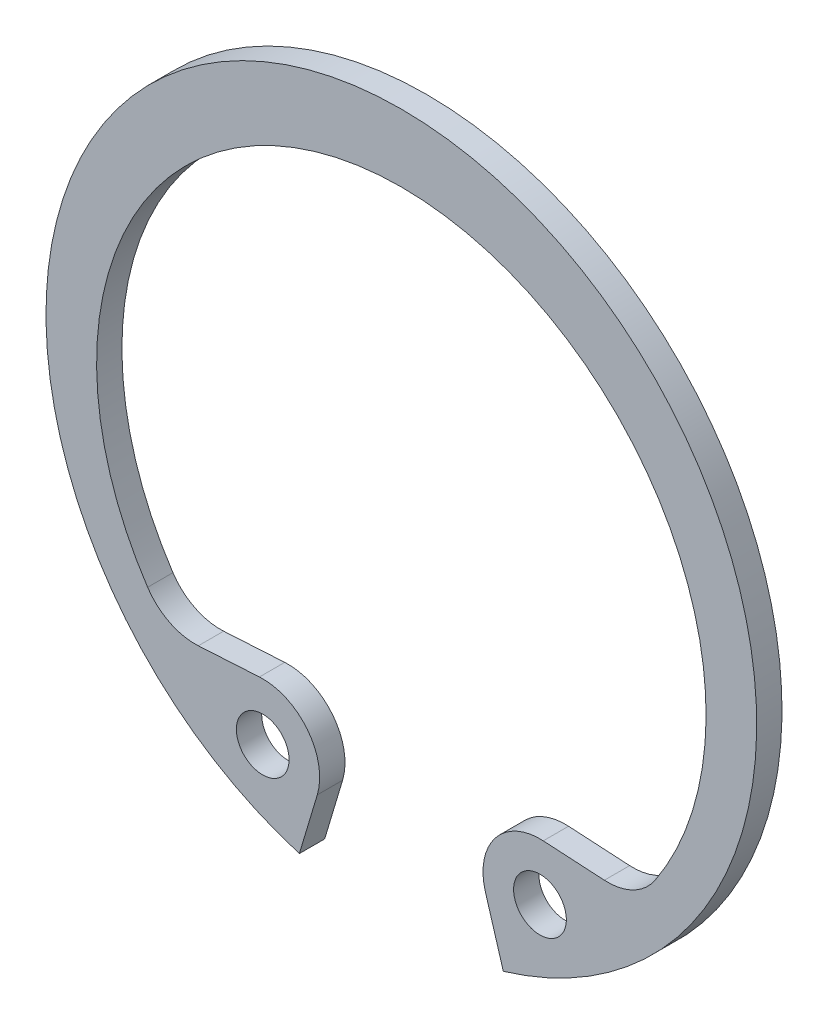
ISO-10303-21;
HEADER;
FILE_DESCRIPTION(('STEP AP214'),'2;1');
FILE_NAME('part.step','',(''),(''),'','','');
FILE_SCHEMA(('AUTOMOTIVE_DESIGN { 1 0 10303 214 1 1 1 1 }'));
ENDSEC;
DATA;
#1=APPLICATION_CONTEXT('core data for automotive mechanical design processes');
#2=APPLICATION_PROTOCOL_DEFINITION('international standard','automotive_design',2000,#1);
#3=PRODUCT_CONTEXT('',#1,'mechanical');
#4=PRODUCT('Part','Part','',(#3));
#5=PRODUCT_RELATED_PRODUCT_CATEGORY('part','',(#4));
#6=PRODUCT_DEFINITION_FORMATION('','',#4);
#7=PRODUCT_DEFINITION_CONTEXT('part definition',#1,'design');
#8=PRODUCT_DEFINITION('design','',#6,#7);
#9=PRODUCT_DEFINITION_SHAPE('','',#8);
#10=(LENGTH_UNIT() NAMED_UNIT(*) SI_UNIT(.MILLI.,.METRE.));
#11=(NAMED_UNIT(*) PLANE_ANGLE_UNIT() SI_UNIT($,.RADIAN.));
#12=(NAMED_UNIT(*) SI_UNIT($,.STERADIAN.) SOLID_ANGLE_UNIT());
#13=UNCERTAINTY_MEASURE_WITH_UNIT(LENGTH_MEASURE(1.E-05),#10,'distance_accuracy_value','');
#14=(GEOMETRIC_REPRESENTATION_CONTEXT(3) GLOBAL_UNCERTAINTY_ASSIGNED_CONTEXT((#13)) GLOBAL_UNIT_ASSIGNED_CONTEXT((#10,
#11,#12)) REPRESENTATION_CONTEXT('',''));
#15=CARTESIAN_POINT('',(0.,0.,0.));
#16=DIRECTION('',(0.,0.,1.));
#17=DIRECTION('',(1.,0.,0.));
#18=AXIS2_PLACEMENT_3D('',#15,#16,#17);
#19=CARTESIAN_POINT('',(0.,0.,0.));
#20=DIRECTION('',(0.,0.,1.));
#21=DIRECTION('',(0.999999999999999,0.,0.));
#22=AXIS2_PLACEMENT_3D('',#19,#20,#21);
#23=PLANE('',#22);
#24=CARTESIAN_POINT('',(6.57243608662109,-12.5309849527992,0.));
#25=DIRECTION('',(0.,0.,1.));
#26=DIRECTION('',(0.999999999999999,0.,0.));
#27=AXIS2_PLACEMENT_3D('',#24,#25,#26);
#28=CIRCLE('',#27,1.25);
#29=CARTESIAN_POINT('',(5.3224360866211,-12.5309849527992,0.));
#30=VERTEX_POINT('',#29);
#31=EDGE_CURVE('E129',#30,#30,#28,.T.);
#32=ORIENTED_EDGE('',*,*,#31,.T.);
#33=EDGE_LOOP('',(#32));
#34=FACE_BOUND('',#33,.T.);
#35=CARTESIAN_POINT('',(0.,0.,0.));
#36=DIRECTION('',(0.,0.,1.));
#37=DIRECTION('',(0.999999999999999,0.,0.));
#38=AXIS2_PLACEMENT_3D('',#35,#36,#37);
#39=CIRCLE('',#38,16.85);
#40=CARTESIAN_POINT('',(4.83542107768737,-16.1412887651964,0.));
#41=VERTEX_POINT('',#40);
#42=CARTESIAN_POINT('',(-4.83542107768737,-16.1412887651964,0.));
#43=VERTEX_POINT('',#42);
#44=EDGE_CURVE('E112',#41,#43,#39,.T.);
#45=ORIENTED_EDGE('',*,*,#44,.F.);
#46=DIRECTION('',(0.286968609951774,-0.957939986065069,0.));
#47=VECTOR('',#46,1.);
#48=CARTESIAN_POINT('',(3.9859981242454,-13.305800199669,0.));
#49=LINE('',#48,#47);
#50=CARTESIAN_POINT('',(3.9859981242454,-13.305800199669,0.));
#51=VERTEX_POINT('',#50);
#52=EDGE_CURVE('E146',#51,#41,#49,.T.);
#53=ORIENTED_EDGE('',*,*,#52,.F.);
#54=CARTESIAN_POINT('',(6.57243608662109,-12.5309849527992,0.));
#55=DIRECTION('',(0.,0.,1.));
#56=DIRECTION('',(0.999999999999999,0.,0.));
#57=AXIS2_PLACEMENT_3D('',#54,#55,#56);
#58=CIRCLE('',#57,2.7);
#59=CARTESIAN_POINT('',(6.72896179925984,-9.83552586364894,0.));
#60=VERTEX_POINT('',#59);
#61=EDGE_CURVE('E144',#60,#51,#58,.T.);
#62=ORIENTED_EDGE('',*,*,#61,.F.);
#63=DIRECTION('',(-0.998318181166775,0.0579724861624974,0.));
#64=VECTOR('',#63,1.);
#65=CARTESIAN_POINT('',(9.62633191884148,-10.0037765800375,0.));
#66=LINE('',#65,#64);
#67=CARTESIAN_POINT('',(9.62633191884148,-10.0037765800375,0.));
#68=VERTEX_POINT('',#67);
#69=EDGE_CURVE('E142',#68,#60,#66,.T.);
#70=ORIENTED_EDGE('',*,*,#69,.F.);
#71=CARTESIAN_POINT('',(9.78285763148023,-7.30831749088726,0.));
#72=DIRECTION('',(0.,0.,-1.));
#73=DIRECTION('',(0.999999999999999,0.,0.));
#74=AXIS2_PLACEMENT_3D('',#71,#72,#73);
#75=CIRCLE('',#74,2.7);
#76=CARTESIAN_POINT('',(12.0308334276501,-8.80384576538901,0.));
#77=VERTEX_POINT('',#76);
#78=EDGE_CURVE('E140',#77,#68,#75,.T.);
#79=ORIENTED_EDGE('',*,*,#78,.F.);
#80=CARTESIAN_POINT('',(0.,-0.799999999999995,0.));
#81=DIRECTION('',(0.,0.,-1.));
#82=DIRECTION('',(0.999999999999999,0.,0.));
#83=AXIS2_PLACEMENT_3D('',#80,#81,#82);
#84=CIRCLE('',#83,14.45);
#85=CARTESIAN_POINT('',(-12.0308334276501,-8.80384576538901,0.));
#86=VERTEX_POINT('',#85);
#87=EDGE_CURVE('E138',#86,#77,#84,.T.);
#88=ORIENTED_EDGE('',*,*,#87,.F.);
#89=CARTESIAN_POINT('',(-9.78285763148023,-7.30831749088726,0.));
#90=DIRECTION('',(0.,0.,-1.));
#91=DIRECTION('',(-0.999999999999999,0.,0.));
#92=AXIS2_PLACEMENT_3D('',#89,#90,#91);
#93=CIRCLE('',#92,2.7);
#94=CARTESIAN_POINT('',(-9.62633191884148,-10.0037765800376,0.));
#95=VERTEX_POINT('',#94);
#96=EDGE_CURVE('E136',#95,#86,#93,.T.);
#97=ORIENTED_EDGE('',*,*,#96,.F.);
#98=DIRECTION('',(-0.998318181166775,-0.0579724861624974,0.));
#99=VECTOR('',#98,1.);
#100=CARTESIAN_POINT('',(-9.62633191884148,-10.0037765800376,0.));
#101=LINE('',#100,#99);
#102=CARTESIAN_POINT('',(-6.72896179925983,-9.83552586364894,0.));
#103=VERTEX_POINT('',#102);
#104=EDGE_CURVE('E134',#103,#95,#101,.T.);
#105=ORIENTED_EDGE('',*,*,#104,.F.);
#106=CARTESIAN_POINT('',(-6.57243608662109,-12.5309849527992,0.));
#107=DIRECTION('',(0.,0.,1.));
#108=DIRECTION('',(-0.999999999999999,0.,0.));
#109=AXIS2_PLACEMENT_3D('',#106,#107,#108);
#110=CIRCLE('',#109,2.7);
#111=CARTESIAN_POINT('',(-3.98599812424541,-13.305800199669,0.));
#112=VERTEX_POINT('',#111);
#113=EDGE_CURVE('E114',#112,#103,#110,.T.);
#114=ORIENTED_EDGE('',*,*,#113,.F.);
#115=DIRECTION('',(0.286968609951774,0.957939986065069,0.));
#116=VECTOR('',#115,1.);
#117=CARTESIAN_POINT('',(-3.9859981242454,-13.305800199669,0.));
#118=LINE('',#117,#116);
#119=EDGE_CURVE('E108',#43,#112,#118,.T.);
#120=ORIENTED_EDGE('',*,*,#119,.F.);
#121=EDGE_LOOP('',(#45,#53,#62,#70,#79,#88,#97,#105,#114,#120));
#122=FACE_BOUND('',#121,.T.);
#123=CARTESIAN_POINT('',(-6.57243608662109,-12.5309849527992,0.));
#124=DIRECTION('',(0.,0.,1.));
#125=DIRECTION('',(-0.999999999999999,0.,0.));
#126=AXIS2_PLACEMENT_3D('',#123,#124,#125);
#127=CIRCLE('',#126,1.25);
#128=CARTESIAN_POINT('',(-7.82243608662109,-12.5309849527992,0.));
#129=VERTEX_POINT('',#128);
#130=EDGE_CURVE('E252',#129,#129,#127,.T.);
#131=ORIENTED_EDGE('',*,*,#130,.T.);
#132=EDGE_LOOP('',(#131));
#133=FACE_BOUND('',#132,.T.);
#134=ADVANCED_FACE('F31',(#34,#122,#133),#23,.F.);
#135=CARTESIAN_POINT('',(0.,0.,1.2));
#136=DIRECTION('',(0.,0.,1.));
#137=DIRECTION('',(0.999999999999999,0.,0.));
#138=AXIS2_PLACEMENT_3D('',#135,#136,#137);
#139=PLANE('',#138);
#140=CARTESIAN_POINT('',(6.57243608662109,-12.5309849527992,1.2));
#141=DIRECTION('',(0.,0.,1.));
#142=DIRECTION('',(0.999999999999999,0.,0.));
#143=AXIS2_PLACEMENT_3D('',#140,#141,#142);
#144=CIRCLE('',#143,1.25);
#145=CARTESIAN_POINT('',(5.3224360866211,-12.5309849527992,1.2));
#146=VERTEX_POINT('',#145);
#147=EDGE_CURVE('E126',#146,#146,#144,.T.);
#148=ORIENTED_EDGE('',*,*,#147,.F.);
#149=EDGE_LOOP('',(#148));
#150=FACE_BOUND('',#149,.T.);
#151=CARTESIAN_POINT('',(0.,0.,1.2));
#152=DIRECTION('',(0.,0.,1.));
#153=DIRECTION('',(0.999999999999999,0.,0.));
#154=AXIS2_PLACEMENT_3D('',#151,#152,#153);
#155=CIRCLE('',#154,16.85);
#156=CARTESIAN_POINT('',(4.83542107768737,-16.1412887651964,1.2));
#157=VERTEX_POINT('',#156);
#158=CARTESIAN_POINT('',(-4.83542107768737,-16.1412887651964,1.19999999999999));
#159=VERTEX_POINT('',#158);
#160=EDGE_CURVE('E148',#157,#159,#155,.T.);
#161=ORIENTED_EDGE('',*,*,#160,.T.);
#162=DIRECTION('',(0.286968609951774,0.957939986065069,0.));
#163=VECTOR('',#162,1.);
#164=CARTESIAN_POINT('',(-3.9859981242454,-13.305800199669,1.2));
#165=LINE('',#164,#163);
#166=CARTESIAN_POINT('',(-3.98599812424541,-13.305800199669,1.2));
#167=VERTEX_POINT('',#166);
#168=EDGE_CURVE('E121',#159,#167,#165,.T.);
#169=ORIENTED_EDGE('',*,*,#168,.T.);
#170=CARTESIAN_POINT('',(-6.57243608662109,-12.5309849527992,1.2));
#171=DIRECTION('',(0.,0.,1.));
#172=DIRECTION('',(-0.999999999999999,0.,0.));
#173=AXIS2_PLACEMENT_3D('',#170,#171,#172);
#174=CIRCLE('',#173,2.7);
#175=CARTESIAN_POINT('',(-6.72896179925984,-9.83552586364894,1.2));
#176=VERTEX_POINT('',#175);
#177=EDGE_CURVE('E151',#167,#176,#174,.T.);
#178=ORIENTED_EDGE('',*,*,#177,.T.);
#179=DIRECTION('',(-0.998318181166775,-0.0579724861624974,0.));
#180=VECTOR('',#179,1.);
#181=CARTESIAN_POINT('',(-9.62633191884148,-10.0037765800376,1.2));
#182=LINE('',#181,#180);
#183=CARTESIAN_POINT('',(-9.62633191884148,-10.0037765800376,1.2));
#184=VERTEX_POINT('',#183);
#185=EDGE_CURVE('E153',#176,#184,#182,.T.);
#186=ORIENTED_EDGE('',*,*,#185,.T.);
#187=CARTESIAN_POINT('',(-9.78285763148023,-7.30831749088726,1.2));
#188=DIRECTION('',(0.,0.,-1.));
#189=DIRECTION('',(-0.999999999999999,0.,0.));
#190=AXIS2_PLACEMENT_3D('',#187,#188,#189);
#191=CIRCLE('',#190,2.7);
#192=CARTESIAN_POINT('',(-12.0308334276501,-8.80384576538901,1.2));
#193=VERTEX_POINT('',#192);
#194=EDGE_CURVE('E155',#184,#193,#191,.T.);
#195=ORIENTED_EDGE('',*,*,#194,.T.);
#196=CARTESIAN_POINT('',(0.,-0.799999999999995,1.2));
#197=DIRECTION('',(0.,0.,-1.));
#198=DIRECTION('',(0.999999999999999,0.,0.));
#199=AXIS2_PLACEMENT_3D('',#196,#197,#198);
#200=CIRCLE('',#199,14.45);
#201=CARTESIAN_POINT('',(12.0308334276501,-8.80384576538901,1.2));
#202=VERTEX_POINT('',#201);
#203=EDGE_CURVE('E157',#193,#202,#200,.T.);
#204=ORIENTED_EDGE('',*,*,#203,.T.);
#205=CARTESIAN_POINT('',(9.78285763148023,-7.30831749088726,1.2));
#206=DIRECTION('',(0.,0.,-1.));
#207=DIRECTION('',(0.999999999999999,0.,0.));
#208=AXIS2_PLACEMENT_3D('',#205,#206,#207);
#209=CIRCLE('',#208,2.7);
#210=CARTESIAN_POINT('',(9.62633191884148,-10.0037765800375,1.2));
#211=VERTEX_POINT('',#210);
#212=EDGE_CURVE('E159',#202,#211,#209,.T.);
#213=ORIENTED_EDGE('',*,*,#212,.T.);
#214=DIRECTION('',(-0.998318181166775,0.0579724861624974,0.));
#215=VECTOR('',#214,1.);
#216=CARTESIAN_POINT('',(9.62633191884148,-10.0037765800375,1.2));
#217=LINE('',#216,#215);
#218=CARTESIAN_POINT('',(6.72896179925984,-9.83552586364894,1.2));
#219=VERTEX_POINT('',#218);
#220=EDGE_CURVE('E161',#211,#219,#217,.T.);
#221=ORIENTED_EDGE('',*,*,#220,.T.);
#222=CARTESIAN_POINT('',(6.57243608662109,-12.5309849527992,1.2));
#223=DIRECTION('',(0.,0.,1.));
#224=DIRECTION('',(0.999999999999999,0.,0.));
#225=AXIS2_PLACEMENT_3D('',#222,#223,#224);
#226=CIRCLE('',#225,2.7);
#227=CARTESIAN_POINT('',(3.9859981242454,-13.305800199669,1.2));
#228=VERTEX_POINT('',#227);
#229=EDGE_CURVE('E51',#219,#228,#226,.T.);
#230=ORIENTED_EDGE('',*,*,#229,.T.);
#231=DIRECTION('',(0.286968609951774,-0.957939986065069,0.));
#232=VECTOR('',#231,1.);
#233=CARTESIAN_POINT('',(3.9859981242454,-13.305800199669,1.2));
#234=LINE('',#233,#232);
#235=EDGE_CURVE('E46',#228,#157,#234,.T.);
#236=ORIENTED_EDGE('',*,*,#235,.T.);
#237=EDGE_LOOP('',(#161,#169,#178,#186,#195,#204,#213,#221,#230,#236));
#238=FACE_BOUND('',#237,.T.);
#239=CARTESIAN_POINT('',(-6.57243608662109,-12.5309849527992,1.2));
#240=DIRECTION('',(0.,0.,1.));
#241=DIRECTION('',(-0.999999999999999,0.,0.));
#242=AXIS2_PLACEMENT_3D('',#239,#240,#241);
#243=CIRCLE('',#242,1.25);
#244=CARTESIAN_POINT('',(-7.82243608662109,-12.5309849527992,1.2));
#245=VERTEX_POINT('',#244);
#246=EDGE_CURVE('E249',#245,#245,#243,.T.);
#247=ORIENTED_EDGE('',*,*,#246,.F.);
#248=EDGE_LOOP('',(#247));
#249=FACE_BOUND('',#248,.T.);
#250=ADVANCED_FACE('F191',(#150,#238,#249),#139,.T.);
#251=CARTESIAN_POINT('',(0.,0.,1.2));
#252=DIRECTION('',(0.,0.,-1.));
#253=DIRECTION('',(-0.999999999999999,0.,0.));
#254=AXIS2_PLACEMENT_3D('',#251,#252,#253);
#255=CYLINDRICAL_SURFACE('',#254,16.85);
#256=ORIENTED_EDGE('',*,*,#44,.T.);
#257=DIRECTION('',(0.,0.,-1.));
#258=VECTOR('',#257,1.);
#259=CARTESIAN_POINT('',(-4.83542107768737,-16.1412887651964,1.19999999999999));
#260=LINE('',#259,#258);
#261=EDGE_CURVE('E11',#159,#43,#260,.T.);
#262=ORIENTED_EDGE('',*,*,#261,.F.);
#263=ORIENTED_EDGE('',*,*,#160,.F.);
#264=DIRECTION('',(0.,0.,-1.));
#265=VECTOR('',#264,1.);
#266=CARTESIAN_POINT('',(4.83542107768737,-16.1412887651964,1.2));
#267=LINE('',#266,#265);
#268=EDGE_CURVE('E125',#157,#41,#267,.T.);
#269=ORIENTED_EDGE('',*,*,#268,.T.);
#270=EDGE_LOOP('',(#256,#262,#263,#269));
#271=FACE_BOUND('',#270,.T.);
#272=ADVANCED_FACE('F33',(#271),#255,.T.);
#273=CARTESIAN_POINT('',(-3.9859981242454,-13.305800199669,1.2));
#274=DIRECTION('',(-0.957939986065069,0.286968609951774,0.));
#275=DIRECTION('',(-0.286968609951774,-0.95793998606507,0.));
#276=AXIS2_PLACEMENT_3D('',#273,#274,#275);
#277=PLANE('',#276);
#278=ORIENTED_EDGE('',*,*,#119,.T.);
#279=DIRECTION('',(0.,0.,-1.));
#280=VECTOR('',#279,1.);
#281=CARTESIAN_POINT('',(-3.98599812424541,-13.305800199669,1.2));
#282=LINE('',#281,#280);
#283=EDGE_CURVE('E39',#167,#112,#282,.T.);
#284=ORIENTED_EDGE('',*,*,#283,.F.);
#285=ORIENTED_EDGE('',*,*,#168,.F.);
#286=ORIENTED_EDGE('',*,*,#261,.T.);
#287=EDGE_LOOP('',(#278,#284,#285,#286));
#288=FACE_BOUND('',#287,.T.);
#289=ADVANCED_FACE('F120',(#288),#277,.F.);
#290=CARTESIAN_POINT('',(-6.57243608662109,-12.5309849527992,1.2));
#291=DIRECTION('',(0.,0.,-1.));
#292=DIRECTION('',(-0.999999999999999,0.,0.));
#293=AXIS2_PLACEMENT_3D('',#290,#291,#292);
#294=CYLINDRICAL_SURFACE('',#293,2.7);
#295=ORIENTED_EDGE('',*,*,#113,.T.);
#296=DIRECTION('',(0.,0.,-1.));
#297=VECTOR('',#296,1.);
#298=CARTESIAN_POINT('',(-6.72896179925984,-9.83552586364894,1.2));
#299=LINE('',#298,#297);
#300=EDGE_CURVE('E184',#176,#103,#299,.T.);
#301=ORIENTED_EDGE('',*,*,#300,.F.);
#302=ORIENTED_EDGE('',*,*,#177,.F.);
#303=ORIENTED_EDGE('',*,*,#283,.T.);
#304=EDGE_LOOP('',(#295,#301,#302,#303));
#305=FACE_BOUND('',#304,.T.);
#306=ADVANCED_FACE('F188',(#305),#294,.T.);
#307=CARTESIAN_POINT('',(-9.62633191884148,-10.0037765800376,1.2));
#308=DIRECTION('',(0.0579724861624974,-0.998318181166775,0.));
#309=DIRECTION('',(0.998318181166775,0.0579724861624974,0.));
#310=AXIS2_PLACEMENT_3D('',#307,#308,#309);
#311=PLANE('',#310);
#312=ORIENTED_EDGE('',*,*,#104,.T.);
#313=DIRECTION('',(0.,0.,-1.));
#314=VECTOR('',#313,1.);
#315=CARTESIAN_POINT('',(-9.62633191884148,-10.0037765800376,1.2));
#316=LINE('',#315,#314);
#317=EDGE_CURVE('E181',#184,#95,#316,.T.);
#318=ORIENTED_EDGE('',*,*,#317,.F.);
#319=ORIENTED_EDGE('',*,*,#185,.F.);
#320=ORIENTED_EDGE('',*,*,#300,.T.);
#321=EDGE_LOOP('',(#312,#318,#319,#320));
#322=FACE_BOUND('',#321,.T.);
#323=ADVANCED_FACE('F197',(#322),#311,.F.);
#324=CARTESIAN_POINT('',(-9.78285763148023,-7.30831749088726,1.2));
#325=DIRECTION('',(0.,0.,-1.));
#326=DIRECTION('',(-0.999999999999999,0.,0.));
#327=AXIS2_PLACEMENT_3D('',#324,#325,#326);
#328=CYLINDRICAL_SURFACE('',#327,2.7);
#329=ORIENTED_EDGE('',*,*,#96,.T.);
#330=DIRECTION('',(0.,0.,-1.));
#331=VECTOR('',#330,1.);
#332=CARTESIAN_POINT('',(-12.0308334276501,-8.80384576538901,1.2));
#333=LINE('',#332,#331);
#334=EDGE_CURVE('E178',#193,#86,#333,.T.);
#335=ORIENTED_EDGE('',*,*,#334,.F.);
#336=ORIENTED_EDGE('',*,*,#194,.F.);
#337=ORIENTED_EDGE('',*,*,#317,.T.);
#338=EDGE_LOOP('',(#329,#335,#336,#337));
#339=FACE_BOUND('',#338,.T.);
#340=ADVANCED_FACE('F200',(#339),#328,.F.);
#341=CARTESIAN_POINT('',(0.,-0.799999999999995,1.2));
#342=DIRECTION('',(0.,0.,-1.));
#343=DIRECTION('',(-0.999999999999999,0.,0.));
#344=AXIS2_PLACEMENT_3D('',#341,#342,#343);
#345=CYLINDRICAL_SURFACE('',#344,14.45);
#346=ORIENTED_EDGE('',*,*,#87,.T.);
#347=DIRECTION('',(0.,0.,-1.));
#348=VECTOR('',#347,1.);
#349=CARTESIAN_POINT('',(12.0308334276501,-8.80384576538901,1.2));
#350=LINE('',#349,#348);
#351=EDGE_CURVE('E175',#202,#77,#350,.T.);
#352=ORIENTED_EDGE('',*,*,#351,.F.);
#353=ORIENTED_EDGE('',*,*,#203,.F.);
#354=ORIENTED_EDGE('',*,*,#334,.T.);
#355=EDGE_LOOP('',(#346,#352,#353,#354));
#356=FACE_BOUND('',#355,.T.);
#357=ADVANCED_FACE('F205',(#356),#345,.F.);
#358=CARTESIAN_POINT('',(9.78285763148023,-7.30831749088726,1.2));
#359=DIRECTION('',(0.,0.,-1.));
#360=DIRECTION('',(-0.999999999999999,0.,0.));
#361=AXIS2_PLACEMENT_3D('',#358,#359,#360);
#362=CYLINDRICAL_SURFACE('',#361,2.7);
#363=ORIENTED_EDGE('',*,*,#78,.T.);
#364=DIRECTION('',(0.,0.,-1.));
#365=VECTOR('',#364,1.);
#366=CARTESIAN_POINT('',(9.62633191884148,-10.0037765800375,1.2));
#367=LINE('',#366,#365);
#368=EDGE_CURVE('E172',#211,#68,#367,.T.);
#369=ORIENTED_EDGE('',*,*,#368,.F.);
#370=ORIENTED_EDGE('',*,*,#212,.F.);
#371=ORIENTED_EDGE('',*,*,#351,.T.);
#372=EDGE_LOOP('',(#363,#369,#370,#371));
#373=FACE_BOUND('',#372,.T.);
#374=ADVANCED_FACE('F211',(#373),#362,.F.);
#375=CARTESIAN_POINT('',(9.62633191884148,-10.0037765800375,1.2));
#376=DIRECTION('',(-0.0579724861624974,-0.998318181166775,0.));
#377=DIRECTION('',(0.998318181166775,-0.0579724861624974,0.));
#378=AXIS2_PLACEMENT_3D('',#375,#376,#377);
#379=PLANE('',#378);
#380=ORIENTED_EDGE('',*,*,#69,.T.);
#381=DIRECTION('',(0.,0.,-1.));
#382=VECTOR('',#381,1.);
#383=CARTESIAN_POINT('',(6.72896179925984,-9.83552586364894,1.2));
#384=LINE('',#383,#382);
#385=EDGE_CURVE('E169',#219,#60,#384,.T.);
#386=ORIENTED_EDGE('',*,*,#385,.F.);
#387=ORIENTED_EDGE('',*,*,#220,.F.);
#388=ORIENTED_EDGE('',*,*,#368,.T.);
#389=EDGE_LOOP('',(#380,#386,#387,#388));
#390=FACE_BOUND('',#389,.T.);
#391=ADVANCED_FACE('F215',(#390),#379,.F.);
#392=CARTESIAN_POINT('',(6.57243608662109,-12.5309849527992,1.2));
#393=DIRECTION('',(0.,0.,-1.));
#394=DIRECTION('',(-0.999999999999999,0.,0.));
#395=AXIS2_PLACEMENT_3D('',#392,#393,#394);
#396=CYLINDRICAL_SURFACE('',#395,2.7);
#397=ORIENTED_EDGE('',*,*,#61,.T.);
#398=DIRECTION('',(0.,0.,-1.));
#399=VECTOR('',#398,1.);
#400=CARTESIAN_POINT('',(3.9859981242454,-13.305800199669,1.2));
#401=LINE('',#400,#399);
#402=EDGE_CURVE('E166',#228,#51,#401,.T.);
#403=ORIENTED_EDGE('',*,*,#402,.F.);
#404=ORIENTED_EDGE('',*,*,#229,.F.);
#405=ORIENTED_EDGE('',*,*,#385,.T.);
#406=EDGE_LOOP('',(#397,#403,#404,#405));
#407=FACE_BOUND('',#406,.T.);
#408=ADVANCED_FACE('F218',(#407),#396,.T.);
#409=CARTESIAN_POINT('',(3.9859981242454,-13.305800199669,1.2));
#410=DIRECTION('',(0.957939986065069,0.286968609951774,0.));
#411=DIRECTION('',(-0.286968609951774,0.95793998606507,0.));
#412=AXIS2_PLACEMENT_3D('',#409,#410,#411);
#413=PLANE('',#412);
#414=ORIENTED_EDGE('',*,*,#52,.T.);
#415=ORIENTED_EDGE('',*,*,#268,.F.);
#416=ORIENTED_EDGE('',*,*,#235,.F.);
#417=ORIENTED_EDGE('',*,*,#402,.T.);
#418=EDGE_LOOP('',(#414,#415,#416,#417));
#419=FACE_BOUND('',#418,.T.);
#420=ADVANCED_FACE('F220',(#419),#413,.F.);
#421=CARTESIAN_POINT('',(6.57243608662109,-12.5309849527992,1.2));
#422=DIRECTION('',(0.,0.,-1.));
#423=DIRECTION('',(-0.999999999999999,0.,0.));
#424=AXIS2_PLACEMENT_3D('',#421,#422,#423);
#425=CYLINDRICAL_SURFACE('',#424,1.25);
#426=CARTESIAN_POINT('',(5.3224360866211,-12.5309849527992,1.2));
#427=CARTESIAN_POINT('',(5.3224360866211,-12.5309849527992,1.1875));
#428=CARTESIAN_POINT('',(5.3224360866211,-12.5309849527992,1.175));
#429=CARTESIAN_POINT('',(5.3224360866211,-12.5309849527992,1.15));
#430=CARTESIAN_POINT('',(5.3224360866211,-12.5309849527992,1.1375));
#431=CARTESIAN_POINT('',(5.3224360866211,-12.5309849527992,1.1125));
#432=CARTESIAN_POINT('',(5.3224360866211,-12.5309849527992,1.1));
#433=CARTESIAN_POINT('',(5.3224360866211,-12.5309849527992,1.075));
#434=CARTESIAN_POINT('',(5.3224360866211,-12.5309849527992,1.0625));
#435=CARTESIAN_POINT('',(5.3224360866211,-12.5309849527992,1.0375));
#436=CARTESIAN_POINT('',(5.3224360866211,-12.5309849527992,1.025));
#437=CARTESIAN_POINT('',(5.3224360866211,-12.5309849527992,0.999999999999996));
#438=CARTESIAN_POINT('',(5.3224360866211,-12.5309849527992,0.987499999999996));
#439=CARTESIAN_POINT('',(5.3224360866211,-12.5309849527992,0.962499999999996));
#440=CARTESIAN_POINT('',(5.3224360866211,-12.5309849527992,0.949999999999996));
#441=CARTESIAN_POINT('',(5.3224360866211,-12.5309849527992,0.924999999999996));
#442=CARTESIAN_POINT('',(5.3224360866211,-12.5309849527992,0.912499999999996));
#443=CARTESIAN_POINT('',(5.3224360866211,-12.5309849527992,0.887499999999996));
#444=CARTESIAN_POINT('',(5.3224360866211,-12.5309849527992,0.874999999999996));
#445=CARTESIAN_POINT('',(5.3224360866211,-12.5309849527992,0.849999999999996));
#446=CARTESIAN_POINT('',(5.3224360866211,-12.5309849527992,0.837499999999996));
#447=CARTESIAN_POINT('',(5.3224360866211,-12.5309849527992,0.812499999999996));
#448=CARTESIAN_POINT('',(5.3224360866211,-12.5309849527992,0.799999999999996));
#449=CARTESIAN_POINT('',(5.3224360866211,-12.5309849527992,0.774999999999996));
#450=CARTESIAN_POINT('',(5.3224360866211,-12.5309849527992,0.762499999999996));
#451=CARTESIAN_POINT('',(5.3224360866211,-12.5309849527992,0.737499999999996));
#452=CARTESIAN_POINT('',(5.3224360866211,-12.5309849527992,0.724999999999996));
#453=CARTESIAN_POINT('',(5.3224360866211,-12.5309849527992,0.699999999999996));
#454=CARTESIAN_POINT('',(5.3224360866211,-12.5309849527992,0.687499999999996));
#455=CARTESIAN_POINT('',(5.3224360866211,-12.5309849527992,0.662499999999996));
#456=CARTESIAN_POINT('',(5.3224360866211,-12.5309849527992,0.649999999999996));
#457=CARTESIAN_POINT('',(5.3224360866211,-12.5309849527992,0.624999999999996));
#458=CARTESIAN_POINT('',(5.3224360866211,-12.5309849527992,0.612499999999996));
#459=CARTESIAN_POINT('',(5.3224360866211,-12.5309849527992,0.587499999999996));
#460=CARTESIAN_POINT('',(5.3224360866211,-12.5309849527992,0.574999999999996));
#461=CARTESIAN_POINT('',(5.3224360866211,-12.5309849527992,0.549999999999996));
#462=CARTESIAN_POINT('',(5.3224360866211,-12.5309849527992,0.537499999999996));
#463=CARTESIAN_POINT('',(5.3224360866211,-12.5309849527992,0.512499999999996));
#464=CARTESIAN_POINT('',(5.3224360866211,-12.5309849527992,0.499999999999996));
#465=CARTESIAN_POINT('',(5.3224360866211,-12.5309849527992,0.474999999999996));
#466=CARTESIAN_POINT('',(5.3224360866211,-12.5309849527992,0.462499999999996));
#467=CARTESIAN_POINT('',(5.3224360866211,-12.5309849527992,0.437499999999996));
#468=CARTESIAN_POINT('',(5.3224360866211,-12.5309849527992,0.424999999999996));
#469=CARTESIAN_POINT('',(5.3224360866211,-12.5309849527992,0.399999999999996));
#470=CARTESIAN_POINT('',(5.3224360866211,-12.5309849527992,0.387499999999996));
#471=CARTESIAN_POINT('',(5.3224360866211,-12.5309849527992,0.362499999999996));
#472=CARTESIAN_POINT('',(5.3224360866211,-12.5309849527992,0.349999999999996));
#473=CARTESIAN_POINT('',(5.3224360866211,-12.5309849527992,0.324999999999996));
#474=CARTESIAN_POINT('',(5.3224360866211,-12.5309849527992,0.312499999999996));
#475=CARTESIAN_POINT('',(5.3224360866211,-12.5309849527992,0.287499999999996));
#476=CARTESIAN_POINT('',(5.3224360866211,-12.5309849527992,0.274999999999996));
#477=CARTESIAN_POINT('',(5.3224360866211,-12.5309849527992,0.249999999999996));
#478=CARTESIAN_POINT('',(5.3224360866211,-12.5309849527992,0.237499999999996));
#479=CARTESIAN_POINT('',(5.3224360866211,-12.5309849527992,0.212499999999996));
#480=CARTESIAN_POINT('',(5.3224360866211,-12.5309849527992,0.199999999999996));
#481=CARTESIAN_POINT('',(5.3224360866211,-12.5309849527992,0.174999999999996));
#482=CARTESIAN_POINT('',(5.3224360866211,-12.5309849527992,0.162499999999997));
#483=CARTESIAN_POINT('',(5.3224360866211,-12.5309849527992,0.137499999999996));
#484=CARTESIAN_POINT('',(5.3224360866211,-12.5309849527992,0.124999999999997));
#485=CARTESIAN_POINT('',(5.3224360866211,-12.5309849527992,0.0999999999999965));
#486=CARTESIAN_POINT('',(5.3224360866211,-12.5309849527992,0.0874999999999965));
#487=CARTESIAN_POINT('',(5.3224360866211,-12.5309849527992,0.0624999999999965));
#488=CARTESIAN_POINT('',(5.3224360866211,-12.5309849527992,0.0499999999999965));
#489=CARTESIAN_POINT('',(5.3224360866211,-12.5309849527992,0.0249999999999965));
#490=CARTESIAN_POINT('',(5.3224360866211,-12.5309849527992,0.0124999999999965));
#491=CARTESIAN_POINT('',(5.3224360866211,-12.5309849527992,0.));
#492=B_SPLINE_CURVE_WITH_KNOTS('',3,(#426,#427,#428,#429,#430,#431,#432,#433,#434,#435,#436,
#437,#438,#439,#440,#441,#442,#443,#444,#445,#446,#447,#448,#449,#450,#451,#452,#453,#454,#455,
#456,#457,#458,#459,#460,#461,#462,#463,#464,#465,#466,#467,#468,#469,#470,#471,#472,#473,#474,
#475,#476,#477,#478,#479,#480,#481,#482,#483,#484,#485,#486,#487,#488,#489,#490,#491),
.UNSPECIFIED.,.F.,.F.,(4,2,2,2,2,2,2,2,2,2,2,2,2,2,2,2,2,2,2,2,2,2,2,2,2,2,2,2,2,2,2,2,4),(0.,
0.0375000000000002,0.075,0.1125,0.15,0.1875,0.225,0.2625,0.3,0.3375,0.375,0.4125,0.45,0.4875,
0.525,0.5625,0.6,0.6375,0.675,0.7125,0.75,0.7875,0.825,0.8625,0.9,0.9375,0.975,1.0125,1.05,
1.0875,1.125,1.1625,1.2),.UNSPECIFIED.);
#493=EDGE_CURVE('BSEAM222',#146,#30,#492,.T.);
#494=ORIENTED_EDGE('',*,*,#147,.T.);
#495=ORIENTED_EDGE('',*,*,#31,.F.);
#496=ORIENTED_EDGE('',*,*,#493,.T.);
#497=ORIENTED_EDGE('',*,*,#493,.F.);
#498=EDGE_LOOP('',(#494,#496,#495,#497));
#499=FACE_BOUND('',#498,.T.);
#500=ADVANCED_FACE('F222',(#499),#425,.F.);
#501=CARTESIAN_POINT('',(-6.57243608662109,-12.5309849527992,1.2));
#502=DIRECTION('',(0.,0.,-1.));
#503=DIRECTION('',(-0.999999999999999,0.,0.));
#504=AXIS2_PLACEMENT_3D('',#501,#502,#503);
#505=CYLINDRICAL_SURFACE('',#504,1.25);
#506=CARTESIAN_POINT('',(-7.82243608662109,-12.5309849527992,1.2));
#507=CARTESIAN_POINT('',(-7.82243608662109,-12.5309849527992,1.1875));
#508=CARTESIAN_POINT('',(-7.82243608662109,-12.5309849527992,1.175));
#509=CARTESIAN_POINT('',(-7.82243608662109,-12.5309849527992,1.15));
#510=CARTESIAN_POINT('',(-7.82243608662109,-12.5309849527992,1.1375));
#511=CARTESIAN_POINT('',(-7.82243608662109,-12.5309849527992,1.1125));
#512=CARTESIAN_POINT('',(-7.82243608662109,-12.5309849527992,1.1));
#513=CARTESIAN_POINT('',(-7.82243608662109,-12.5309849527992,1.075));
#514=CARTESIAN_POINT('',(-7.82243608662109,-12.5309849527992,1.0625));
#515=CARTESIAN_POINT('',(-7.82243608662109,-12.5309849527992,1.0375));
#516=CARTESIAN_POINT('',(-7.82243608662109,-12.5309849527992,1.025));
#517=CARTESIAN_POINT('',(-7.82243608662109,-12.5309849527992,0.999999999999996));
#518=CARTESIAN_POINT('',(-7.82243608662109,-12.5309849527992,0.987499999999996));
#519=CARTESIAN_POINT('',(-7.82243608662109,-12.5309849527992,0.962499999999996));
#520=CARTESIAN_POINT('',(-7.82243608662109,-12.5309849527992,0.949999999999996));
#521=CARTESIAN_POINT('',(-7.82243608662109,-12.5309849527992,0.924999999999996));
#522=CARTESIAN_POINT('',(-7.82243608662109,-12.5309849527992,0.912499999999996));
#523=CARTESIAN_POINT('',(-7.82243608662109,-12.5309849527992,0.887499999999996));
#524=CARTESIAN_POINT('',(-7.82243608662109,-12.5309849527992,0.874999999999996));
#525=CARTESIAN_POINT('',(-7.82243608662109,-12.5309849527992,0.849999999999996));
#526=CARTESIAN_POINT('',(-7.82243608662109,-12.5309849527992,0.837499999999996));
#527=CARTESIAN_POINT('',(-7.82243608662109,-12.5309849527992,0.812499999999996));
#528=CARTESIAN_POINT('',(-7.82243608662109,-12.5309849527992,0.799999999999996));
#529=CARTESIAN_POINT('',(-7.82243608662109,-12.5309849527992,0.774999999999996));
#530=CARTESIAN_POINT('',(-7.82243608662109,-12.5309849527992,0.762499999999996));
#531=CARTESIAN_POINT('',(-7.82243608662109,-12.5309849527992,0.737499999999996));
#532=CARTESIAN_POINT('',(-7.82243608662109,-12.5309849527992,0.724999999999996));
#533=CARTESIAN_POINT('',(-7.82243608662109,-12.5309849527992,0.699999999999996));
#534=CARTESIAN_POINT('',(-7.82243608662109,-12.5309849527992,0.687499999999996));
#535=CARTESIAN_POINT('',(-7.82243608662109,-12.5309849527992,0.662499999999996));
#536=CARTESIAN_POINT('',(-7.82243608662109,-12.5309849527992,0.649999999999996));
#537=CARTESIAN_POINT('',(-7.82243608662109,-12.5309849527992,0.624999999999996));
#538=CARTESIAN_POINT('',(-7.82243608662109,-12.5309849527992,0.612499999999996));
#539=CARTESIAN_POINT('',(-7.82243608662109,-12.5309849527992,0.587499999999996));
#540=CARTESIAN_POINT('',(-7.82243608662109,-12.5309849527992,0.574999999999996));
#541=CARTESIAN_POINT('',(-7.82243608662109,-12.5309849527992,0.549999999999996));
#542=CARTESIAN_POINT('',(-7.82243608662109,-12.5309849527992,0.537499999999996));
#543=CARTESIAN_POINT('',(-7.82243608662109,-12.5309849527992,0.512499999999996));
#544=CARTESIAN_POINT('',(-7.82243608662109,-12.5309849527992,0.499999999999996));
#545=CARTESIAN_POINT('',(-7.82243608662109,-12.5309849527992,0.474999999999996));
#546=CARTESIAN_POINT('',(-7.82243608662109,-12.5309849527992,0.462499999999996));
#547=CARTESIAN_POINT('',(-7.82243608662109,-12.5309849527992,0.437499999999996));
#548=CARTESIAN_POINT('',(-7.82243608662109,-12.5309849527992,0.424999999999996));
#549=CARTESIAN_POINT('',(-7.82243608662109,-12.5309849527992,0.399999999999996));
#550=CARTESIAN_POINT('',(-7.82243608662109,-12.5309849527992,0.387499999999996));
#551=CARTESIAN_POINT('',(-7.82243608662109,-12.5309849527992,0.362499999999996));
#552=CARTESIAN_POINT('',(-7.82243608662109,-12.5309849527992,0.349999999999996));
#553=CARTESIAN_POINT('',(-7.82243608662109,-12.5309849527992,0.324999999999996));
#554=CARTESIAN_POINT('',(-7.82243608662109,-12.5309849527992,0.312499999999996));
#555=CARTESIAN_POINT('',(-7.82243608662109,-12.5309849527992,0.287499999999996));
#556=CARTESIAN_POINT('',(-7.82243608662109,-12.5309849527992,0.274999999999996));
#557=CARTESIAN_POINT('',(-7.82243608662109,-12.5309849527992,0.249999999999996));
#558=CARTESIAN_POINT('',(-7.82243608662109,-12.5309849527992,0.237499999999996));
#559=CARTESIAN_POINT('',(-7.82243608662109,-12.5309849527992,0.212499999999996));
#560=CARTESIAN_POINT('',(-7.82243608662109,-12.5309849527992,0.199999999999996));
#561=CARTESIAN_POINT('',(-7.82243608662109,-12.5309849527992,0.174999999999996));
#562=CARTESIAN_POINT('',(-7.82243608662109,-12.5309849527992,0.162499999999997));
#563=CARTESIAN_POINT('',(-7.82243608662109,-12.5309849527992,0.137499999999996));
#564=CARTESIAN_POINT('',(-7.82243608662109,-12.5309849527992,0.124999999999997));
#565=CARTESIAN_POINT('',(-7.82243608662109,-12.5309849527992,0.0999999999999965));
#566=CARTESIAN_POINT('',(-7.82243608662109,-12.5309849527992,0.0874999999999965));
#567=CARTESIAN_POINT('',(-7.82243608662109,-12.5309849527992,0.0624999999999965));
#568=CARTESIAN_POINT('',(-7.82243608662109,-12.5309849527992,0.0499999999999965));
#569=CARTESIAN_POINT('',(-7.82243608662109,-12.5309849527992,0.0249999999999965));
#570=CARTESIAN_POINT('',(-7.82243608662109,-12.5309849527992,0.0124999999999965));
#571=CARTESIAN_POINT('',(-7.82243608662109,-12.5309849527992,0.));
#572=B_SPLINE_CURVE_WITH_KNOTS('',3,(#506,#507,#508,#509,#510,#511,#512,#513,#514,#515,#516,
#517,#518,#519,#520,#521,#522,#523,#524,#525,#526,#527,#528,#529,#530,#531,#532,#533,#534,#535,
#536,#537,#538,#539,#540,#541,#542,#543,#544,#545,#546,#547,#548,#549,#550,#551,#552,#553,#554,
#555,#556,#557,#558,#559,#560,#561,#562,#563,#564,#565,#566,#567,#568,#569,#570,#571),
.UNSPECIFIED.,.F.,.F.,(4,2,2,2,2,2,2,2,2,2,2,2,2,2,2,2,2,2,2,2,2,2,2,2,2,2,2,2,2,2,2,2,4),(0.,
0.0375000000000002,0.075,0.1125,0.15,0.1875,0.225,0.2625,0.3,0.3375,0.375,0.4125,0.45,0.4875,
0.525,0.5625,0.6,0.6375,0.675,0.7125,0.75,0.7875,0.825,0.8625,0.9,0.9375,0.975,1.0125,1.05,
1.0875,1.125,1.1625,1.2),.UNSPECIFIED.);
#573=EDGE_CURVE('BSEAM228',#245,#129,#572,.T.);
#574=ORIENTED_EDGE('',*,*,#246,.T.);
#575=ORIENTED_EDGE('',*,*,#130,.F.);
#576=ORIENTED_EDGE('',*,*,#573,.T.);
#577=ORIENTED_EDGE('',*,*,#573,.F.);
#578=EDGE_LOOP('',(#574,#576,#575,#577));
#579=FACE_BOUND('',#578,.T.);
#580=ADVANCED_FACE('F228',(#579),#505,.F.);
#581=CLOSED_SHELL('',(#134,#250,#272,#289,#306,#323,#340,#357,#374,#391,#408,#420,#500,#580));
#582=MANIFOLD_SOLID_BREP('B2',#581);
#583=ADVANCED_BREP_SHAPE_REPRESENTATION('',(#18,#582),#14);
#584=SHAPE_DEFINITION_REPRESENTATION(#9,#583);
ENDSEC;
END-ISO-10303-21;
